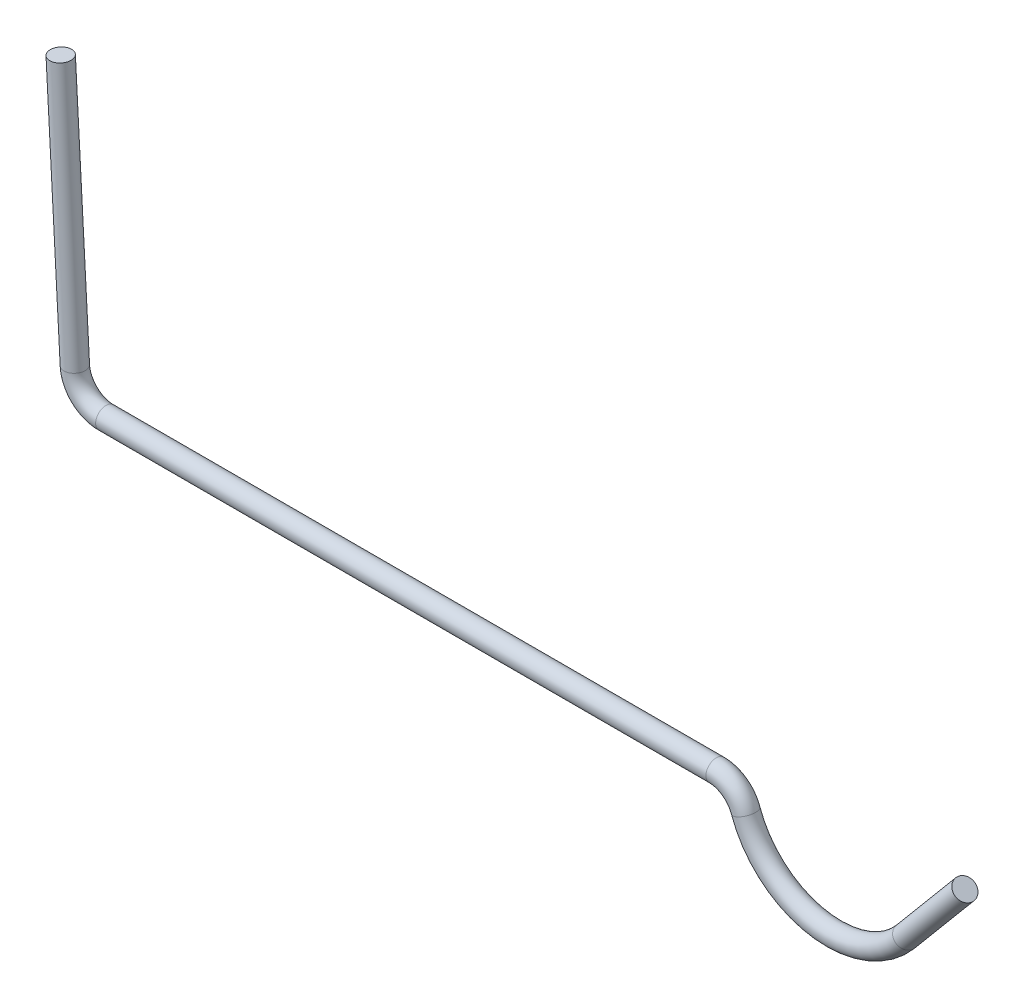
ISO-10303-21;
HEADER;
FILE_DESCRIPTION(('STEP AP214'),'2;1');
FILE_NAME('part.step','',(''),(''),'','','');
FILE_SCHEMA(('AUTOMOTIVE_DESIGN { 1 0 10303 214 1 1 1 1 }'));
ENDSEC;
DATA;
#1=APPLICATION_CONTEXT('core data for automotive mechanical design processes');
#2=APPLICATION_PROTOCOL_DEFINITION('international standard','automotive_design',2000,#1);
#3=PRODUCT_CONTEXT('',#1,'mechanical');
#4=PRODUCT('Part','Part','',(#3));
#5=PRODUCT_RELATED_PRODUCT_CATEGORY('part','',(#4));
#6=PRODUCT_DEFINITION_FORMATION('','',#4);
#7=PRODUCT_DEFINITION_CONTEXT('part definition',#1,'design');
#8=PRODUCT_DEFINITION('design','',#6,#7);
#9=PRODUCT_DEFINITION_SHAPE('','',#8);
#10=(LENGTH_UNIT() NAMED_UNIT(*) SI_UNIT(.MILLI.,.METRE.));
#11=(NAMED_UNIT(*) PLANE_ANGLE_UNIT() SI_UNIT($,.RADIAN.));
#12=(NAMED_UNIT(*) SI_UNIT($,.STERADIAN.) SOLID_ANGLE_UNIT());
#13=UNCERTAINTY_MEASURE_WITH_UNIT(LENGTH_MEASURE(1.E-05),#10,'distance_accuracy_value','');
#14=(GEOMETRIC_REPRESENTATION_CONTEXT(3) GLOBAL_UNCERTAINTY_ASSIGNED_CONTEXT((#13)) GLOBAL_UNIT_ASSIGNED_CONTEXT((#10,
#11,#12)) REPRESENTATION_CONTEXT('',''));
#15=CARTESIAN_POINT('',(0.,0.,0.));
#16=DIRECTION('',(0.,0.,1.));
#17=DIRECTION('',(1.,0.,0.));
#18=AXIS2_PLACEMENT_3D('',#15,#16,#17);
#19=CARTESIAN_POINT('',(20.6469413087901,0.5,1.11022302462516E-13));
#20=DIRECTION('',(0.642787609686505,0.766044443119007,0.));
#21=DIRECTION('',(-0.766044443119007,0.642787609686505,0.));
#22=AXIS2_PLACEMENT_3D('',#19,#20,#21);
#23=PLANE('',#22);
#24=CARTESIAN_POINT('',(20.6469413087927,0.499999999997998,0.));
#25=DIRECTION('',(0.642787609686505,0.766044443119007,0.));
#26=DIRECTION('',(-0.766044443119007,0.642787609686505,0.));
#27=AXIS2_PLACEMENT_3D('',#24,#25,#26);
#28=CIRCLE('',#27,0.25);
#29=CARTESIAN_POINT('',(20.4554301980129,0.660696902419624,0.));
#30=VERTEX_POINT('',#29);
#31=EDGE_CURVE('E17',#30,#30,#28,.F.);
#32=ORIENTED_EDGE('',*,*,#31,.F.);
#33=EDGE_LOOP('',(#32));
#34=FACE_BOUND('',#33,.T.);
#35=ADVANCED_FACE('F14',(#34),#23,.T.);
#36=CARTESIAN_POINT('',(19.22359999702,-1.196272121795,0.));
#37=DIRECTION('',(0.642787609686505,0.766044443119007,0.));
#38=DIRECTION('',(-0.766044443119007,0.642787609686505,0.));
#39=AXIS2_PLACEMENT_3D('',#36,#37,#38);
#40=CYLINDRICAL_SURFACE('',#39,0.25);
#41=ORIENTED_EDGE('',*,*,#31,.T.);
#42=EDGE_LOOP('',(#41));
#43=FACE_BOUND('',#42,.T.);
#44=CARTESIAN_POINT('',(19.2235999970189,-1.19627212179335,4.93800152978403E-11));
#45=DIRECTION('',(0.642787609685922,0.766044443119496,0.));
#46=DIRECTION('',(0.766044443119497,-0.64278760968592,0.));
#47=AXIS2_PLACEMENT_3D('',#44,#45,#46);
#48=CIRCLE('',#47,0.25);
#49=CARTESIAN_POINT('',(19.4151111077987,-1.35696902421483,4.9380006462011E-11));
#50=VERTEX_POINT('',#49);
#51=EDGE_CURVE('E53',#50,#50,#48,.F.);
#52=ORIENTED_EDGE('',*,*,#51,.F.);
#53=EDGE_LOOP('',(#52));
#54=FACE_BOUND('',#53,.T.);
#55=ADVANCED_FACE('F62',(#43,#54),#40,.T.);
#56=CARTESIAN_POINT('',(-1.08958700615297,6.99999999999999,0.));
#57=DIRECTION('',(0.0540788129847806,-0.998536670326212,0.));
#58=DIRECTION('',(0.998536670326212,0.0540788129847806,0.));
#59=AXIS2_PLACEMENT_3D('',#56,#57,#58);
#60=PLANE('',#59);
#61=CARTESIAN_POINT('',(-1.08958700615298,7.0000000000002,0.));
#62=DIRECTION('',(0.0540788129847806,-0.998536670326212,0.));
#63=DIRECTION('',(0.998536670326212,0.0540788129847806,0.));
#64=AXIS2_PLACEMENT_3D('',#61,#62,#63);
#65=CIRCLE('',#64,0.25);
#66=CARTESIAN_POINT('',(-0.839952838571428,7.01351970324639,0.));
#67=VERTEX_POINT('',#66);
#68=EDGE_CURVE('E50',#67,#67,#65,.T.);
#69=ORIENTED_EDGE('',*,*,#68,.F.);
#70=EDGE_LOOP('',(#69));
#71=FACE_BOUND('',#70,.T.);
#72=ADVANCED_FACE('F60',(#71),#60,.F.);
#73=CARTESIAN_POINT('',(-1.08958700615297,6.99999999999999,0.));
#74=DIRECTION('',(0.0540788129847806,-0.998536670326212,0.));
#75=DIRECTION('',(0.998536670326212,0.0540788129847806,0.));
#76=AXIS2_PLACEMENT_3D('',#73,#74,#75);
#77=CYLINDRICAL_SURFACE('',#76,0.25);
#78=CARTESIAN_POINT('',(-0.748902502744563,0.709440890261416,0.));
#79=DIRECTION('',(0.0540788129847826,-0.998536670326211,0.));
#80=DIRECTION('',(-0.998536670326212,-0.0540788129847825,0.));
#81=AXIS2_PLACEMENT_3D('',#78,#79,#80);
#82=CIRCLE('',#81,0.25);
#83=CARTESIAN_POINT('',(-0.998536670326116,0.69592118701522,0.));
#84=VERTEX_POINT('',#83);
#85=EDGE_CURVE('E48',#84,#84,#82,.T.);
#86=ORIENTED_EDGE('',*,*,#85,.F.);
#87=EDGE_LOOP('',(#86));
#88=FACE_BOUND('',#87,.T.);
#89=ORIENTED_EDGE('',*,*,#68,.T.);
#90=EDGE_LOOP('',(#89));
#91=FACE_BOUND('',#90,.T.);
#92=ADVANCED_FACE('F58',(#88,#91),#77,.T.);
#93=CARTESIAN_POINT('',(17.5,0.25,4.93800948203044E-11));
#94=DIRECTION('',(0.,0.,1.));
#95=DIRECTION('',(0.942809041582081,0.333333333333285,0.));
#96=AXIS2_PLACEMENT_3D('',#93,#94,#95);
#97=TOROIDAL_SURFACE('',#96,2.25000000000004,0.25);
#98=ORIENTED_EDGE('',*,*,#51,.T.);
#99=EDGE_LOOP('',(#98));
#100=FACE_BOUND('',#99,.T.);
#101=CARTESIAN_POINT('',(15.3786796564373,-0.500000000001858,-2.95831542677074E-10));
#102=DIRECTION('',(0.333333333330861,-0.942809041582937,0.));
#103=DIRECTION('',(0.942809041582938,0.333333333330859,0.));
#104=AXIS2_PLACEMENT_3D('',#101,#102,#103);
#105=CIRCLE('',#104,0.25);
#106=CARTESIAN_POINT('',(15.614381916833,-0.416666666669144,-2.95831551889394E-10));
#107=VERTEX_POINT('',#106);
#108=EDGE_CURVE('E26',#107,#107,#105,.F.);
#109=ORIENTED_EDGE('',*,*,#108,.F.);
#110=EDGE_LOOP('',(#109));
#111=FACE_BOUND('',#110,.T.);
#112=ADVANCED_FACE('F42',(#100,#111),#97,.T.);
#113=CARTESIAN_POINT('',(0.,0.750000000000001,0.));
#114=DIRECTION('',(0.,0.,1.));
#115=DIRECTION('',(0.998536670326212,0.0540788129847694,0.));
#116=AXIS2_PLACEMENT_3D('',#113,#114,#115);
#117=TOROIDAL_SURFACE('',#116,0.74999999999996,0.25);
#118=ORIENTED_EDGE('',*,*,#85,.T.);
#119=EDGE_LOOP('',(#118));
#120=FACE_BOUND('',#119,.T.);
#121=CARTESIAN_POINT('',(0.,0.,0.));
#122=DIRECTION('',(1.,0.,0.));
#123=DIRECTION('',(0.,0.,-1.));
#124=AXIS2_PLACEMENT_3D('',#121,#122,#123);
#125=CIRCLE('',#124,0.25);
#126=CARTESIAN_POINT('',(0.,0.,-0.25));
#127=VERTEX_POINT('',#126);
#128=EDGE_CURVE('E21',#127,#127,#125,.T.);
#129=ORIENTED_EDGE('',*,*,#128,.F.);
#130=EDGE_LOOP('',(#129));
#131=FACE_BOUND('',#130,.T.);
#132=ADVANCED_FACE('F38',(#120,#131),#117,.T.);
#133=CARTESIAN_POINT('',(14.6715728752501,-0.750000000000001,-2.95831515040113E-10));
#134=DIRECTION('',(0.,0.,-1.));
#135=DIRECTION('',(0.,-1.,0.));
#136=AXIS2_PLACEMENT_3D('',#133,#134,#135);
#137=TOROIDAL_SURFACE('',#136,0.749999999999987,0.25);
#138=CARTESIAN_POINT('',(14.67157287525,0.,0.));
#139=DIRECTION('',(1.,0.,0.));
#140=DIRECTION('',(0.,0.,-1.));
#141=AXIS2_PLACEMENT_3D('',#138,#139,#140);
#142=CIRCLE('',#141,0.25);
#143=CARTESIAN_POINT('',(14.67157287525,0.,-0.249999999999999));
#144=VERTEX_POINT('',#143);
#145=EDGE_CURVE('E10',#144,#144,#142,.F.);
#146=ORIENTED_EDGE('',*,*,#145,.F.);
#147=EDGE_LOOP('',(#146));
#148=FACE_BOUND('',#147,.T.);
#149=ORIENTED_EDGE('',*,*,#108,.T.);
#150=EDGE_LOOP('',(#149));
#151=FACE_BOUND('',#150,.T.);
#152=ADVANCED_FACE('F33',(#148,#151),#137,.T.);
#153=CARTESIAN_POINT('',(0.,0.,0.));
#154=DIRECTION('',(1.,0.,0.));
#155=DIRECTION('',(0.,0.,-1.));
#156=AXIS2_PLACEMENT_3D('',#153,#154,#155);
#157=CYLINDRICAL_SURFACE('',#156,0.25);
#158=ORIENTED_EDGE('',*,*,#145,.T.);
#159=EDGE_LOOP('',(#158));
#160=FACE_BOUND('',#159,.T.);
#161=ORIENTED_EDGE('',*,*,#128,.T.);
#162=EDGE_LOOP('',(#161));
#163=FACE_BOUND('',#162,.T.);
#164=ADVANCED_FACE('F37',(#160,#163),#157,.T.);
#165=CLOSED_SHELL('',(#35,#55,#72,#92,#112,#132,#152,#164));
#166=MANIFOLD_SOLID_BREP('B1',#165);
#167=ADVANCED_BREP_SHAPE_REPRESENTATION('',(#18,#166),#14);
#168=SHAPE_DEFINITION_REPRESENTATION(#9,#167);
ENDSEC;
END-ISO-10303-21;
